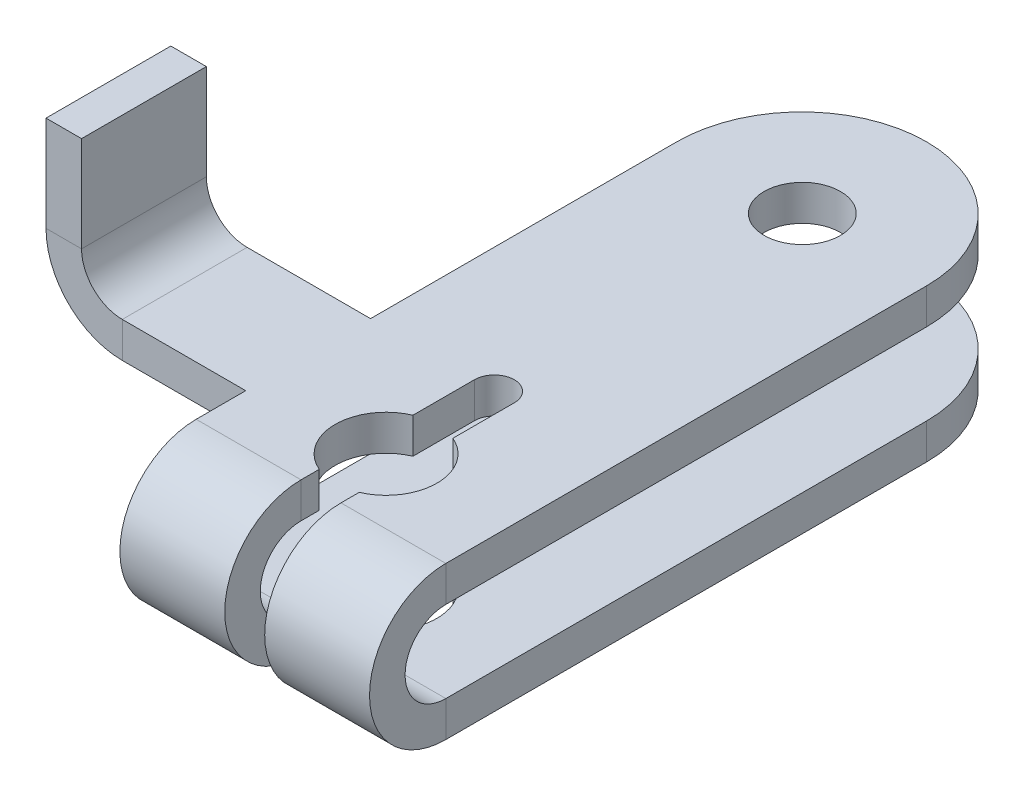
ISO-10303-21;
HEADER;
FILE_DESCRIPTION(('STEP AP214'),'2;1');
FILE_NAME('part.step','',(''),(''),'','','');
FILE_SCHEMA(('AUTOMOTIVE_DESIGN { 1 0 10303 214 1 1 1 1 }'));
ENDSEC;
DATA;
#1=APPLICATION_CONTEXT('core data for automotive mechanical design processes');
#2=APPLICATION_PROTOCOL_DEFINITION('international standard','automotive_design',2000,#1);
#3=PRODUCT_CONTEXT('',#1,'mechanical');
#4=PRODUCT('Part','Part','',(#3));
#5=PRODUCT_RELATED_PRODUCT_CATEGORY('part','',(#4));
#6=PRODUCT_DEFINITION_FORMATION('','',#4);
#7=PRODUCT_DEFINITION_CONTEXT('part definition',#1,'design');
#8=PRODUCT_DEFINITION('design','',#6,#7);
#9=PRODUCT_DEFINITION_SHAPE('','',#8);
#10=(LENGTH_UNIT() NAMED_UNIT(*) SI_UNIT(.MILLI.,.METRE.));
#11=(NAMED_UNIT(*) PLANE_ANGLE_UNIT() SI_UNIT($,.RADIAN.));
#12=(NAMED_UNIT(*) SI_UNIT($,.STERADIAN.) SOLID_ANGLE_UNIT());
#13=UNCERTAINTY_MEASURE_WITH_UNIT(LENGTH_MEASURE(1.E-05),#10,'distance_accuracy_value','');
#14=(GEOMETRIC_REPRESENTATION_CONTEXT(3) GLOBAL_UNCERTAINTY_ASSIGNED_CONTEXT((#13)) GLOBAL_UNIT_ASSIGNED_CONTEXT((#10,
#11,#12)) REPRESENTATION_CONTEXT('',''));
#15=CARTESIAN_POINT('',(0.,0.,0.));
#16=DIRECTION('',(0.,0.,1.));
#17=DIRECTION('',(1.,0.,0.));
#18=AXIS2_PLACEMENT_3D('',#15,#16,#17);
#19=CARTESIAN_POINT('',(7.9375,-2.5908,0.));
#20=DIRECTION('',(0.,1.,0.));
#21=DIRECTION('',(0.,0.,1.));
#22=AXIS2_PLACEMENT_3D('',#19,#20,#21);
#23=PLANE('',#22);
#24=CARTESIAN_POINT('',(0.,-2.5908,-30.607));
#25=DIRECTION('',(0.,1.,0.));
#26=DIRECTION('',(0.,0.,1.));
#27=AXIS2_PLACEMENT_3D('',#24,#25,#26);
#28=CIRCLE('',#27,2.4257);
#29=CARTESIAN_POINT('',(0.,-2.5908,-28.1813));
#30=VERTEX_POINT('',#29);
#31=EDGE_CURVE('E497',#30,#30,#28,.T.);
#32=ORIENTED_EDGE('',*,*,#31,.F.);
#33=EDGE_LOOP('',(#32));
#34=FACE_BOUND('',#33,.T.);
#35=CARTESIAN_POINT('',(0.,-2.5908,-11.0236));
#36=DIRECTION('',(0.,1.,0.));
#37=DIRECTION('',(0.,0.,1.));
#38=AXIS2_PLACEMENT_3D('',#35,#36,#37);
#39=CIRCLE('',#38,1.27);
#40=CARTESIAN_POINT('',(1.27,-2.5908,-11.0236));
#41=VERTEX_POINT('',#40);
#42=CARTESIAN_POINT('',(-1.27,-2.5908,-11.0236));
#43=VERTEX_POINT('',#42);
#44=EDGE_CURVE('E309',#41,#43,#39,.T.);
#45=ORIENTED_EDGE('',*,*,#44,.F.);
#46=DIRECTION('',(0.,0.,-1.));
#47=VECTOR('',#46,1.);
#48=CARTESIAN_POINT('',(1.27,-2.5908,0.));
#49=LINE('',#48,#47);
#50=CARTESIAN_POINT('',(1.27,-2.5908,-7.11632099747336));
#51=VERTEX_POINT('',#50);
#52=EDGE_CURVE('E292',#51,#41,#49,.T.);
#53=ORIENTED_EDGE('',*,*,#52,.F.);
#54=CARTESIAN_POINT('',(0.,-2.5908,-4.13723015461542));
#55=DIRECTION('',(0.,1.,0.));
#56=DIRECTION('',(0.,0.,1.));
#57=AXIS2_PLACEMENT_3D('',#54,#55,#56);
#58=CIRCLE('',#57,3.2385);
#59=CARTESIAN_POINT('',(1.27,-2.5908,-1.15813931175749));
#60=VERTEX_POINT('',#59);
#61=EDGE_CURVE('E395',#60,#51,#58,.T.);
#62=ORIENTED_EDGE('',*,*,#61,.F.);
#63=DIRECTION('',(0.,0.,-1.));
#64=VECTOR('',#63,1.);
#65=CARTESIAN_POINT('',(1.27,-2.5908,0.));
#66=LINE('',#65,#64);
#67=CARTESIAN_POINT('',(1.27,-2.5908,0.));
#68=VERTEX_POINT('',#67);
#69=EDGE_CURVE('E346',#68,#60,#66,.T.);
#70=ORIENTED_EDGE('',*,*,#69,.F.);
#71=DIRECTION('',(-1.,0.,0.));
#72=VECTOR('',#71,1.);
#73=CARTESIAN_POINT('',(7.9375,-2.5908,0.));
#74=LINE('',#73,#72);
#75=CARTESIAN_POINT('',(7.9375,-2.5908,0.));
#76=VERTEX_POINT('',#75);
#77=EDGE_CURVE('E510',#76,#68,#74,.T.);
#78=ORIENTED_EDGE('',*,*,#77,.F.);
#79=DIRECTION('',(0.,0.,-1.));
#80=VECTOR('',#79,1.);
#81=CARTESIAN_POINT('',(7.9375,-2.5908,0.));
#82=LINE('',#81,#80);
#83=CARTESIAN_POINT('',(7.9375,-2.5908,-30.5689));
#84=VERTEX_POINT('',#83);
#85=EDGE_CURVE('E513',#76,#84,#82,.T.);
#86=ORIENTED_EDGE('',*,*,#85,.T.);
#87=CARTESIAN_POINT('',(0.,-2.5908,-30.5689));
#88=DIRECTION('',(0.,1.,0.));
#89=DIRECTION('',(0.,0.,1.));
#90=AXIS2_PLACEMENT_3D('',#87,#88,#89);
#91=CIRCLE('',#90,7.9375);
#92=CARTESIAN_POINT('',(0.,-2.5908,-38.5064));
#93=VERTEX_POINT('',#92);
#94=EDGE_CURVE('E500',#84,#93,#91,.T.);
#95=ORIENTED_EDGE('',*,*,#94,.T.);
#96=CARTESIAN_POINT('',(0.,-2.5908,-30.5689));
#97=DIRECTION('',(0.,1.,0.));
#98=DIRECTION('',(0.,0.,1.));
#99=AXIS2_PLACEMENT_3D('',#96,#97,#98);
#100=CIRCLE('',#99,7.9375);
#101=CARTESIAN_POINT('',(-7.9375,-2.5908,-30.5689));
#102=VERTEX_POINT('',#101);
#103=EDGE_CURVE('E503',#93,#102,#100,.T.);
#104=ORIENTED_EDGE('',*,*,#103,.T.);
#105=DIRECTION('',(0.,0.,-1.));
#106=VECTOR('',#105,1.);
#107=CARTESIAN_POINT('',(-7.9375,-2.5908,0.));
#108=LINE('',#107,#106);
#109=CARTESIAN_POINT('',(-7.9375,-2.5908,0.));
#110=VERTEX_POINT('',#109);
#111=EDGE_CURVE('E506',#110,#102,#108,.T.);
#112=ORIENTED_EDGE('',*,*,#111,.F.);
#113=CARTESIAN_POINT('',(-1.27,-2.5908,0.));
#114=VERTEX_POINT('',#113);
#115=EDGE_CURVE('E509',#114,#110,#74,.T.);
#116=ORIENTED_EDGE('',*,*,#115,.F.);
#117=DIRECTION('',(0.,0.,1.));
#118=VECTOR('',#117,1.);
#119=CARTESIAN_POINT('',(-1.27,-2.5908,0.));
#120=LINE('',#119,#118);
#121=CARTESIAN_POINT('',(-1.27,-2.5908,-1.15813931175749));
#122=VERTEX_POINT('',#121);
#123=EDGE_CURVE('E352',#122,#114,#120,.T.);
#124=ORIENTED_EDGE('',*,*,#123,.F.);
#125=CARTESIAN_POINT('',(-1.27,-2.5908,-7.11632099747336));
#126=VERTEX_POINT('',#125);
#127=EDGE_CURVE('E394',#126,#122,#58,.T.);
#128=ORIENTED_EDGE('',*,*,#127,.F.);
#129=DIRECTION('',(0.,0.,1.));
#130=VECTOR('',#129,1.);
#131=CARTESIAN_POINT('',(-1.27,-2.5908,0.));
#132=LINE('',#131,#130);
#133=EDGE_CURVE('E73',#43,#126,#132,.T.);
#134=ORIENTED_EDGE('',*,*,#133,.F.);
#135=EDGE_LOOP('',(#45,#53,#62,#70,#78,#86,#95,#104,#112,#116,#124,#128,#134));
#136=FACE_BOUND('',#135,.T.);
#137=ADVANCED_FACE('F57',(#34,#136),#23,.T.);
#138=CARTESIAN_POINT('',(7.9375,-4.8514,0.));
#139=DIRECTION('',(0.,1.,0.));
#140=DIRECTION('',(0.,0.,1.));
#141=AXIS2_PLACEMENT_3D('',#138,#139,#140);
#142=PLANE('',#141);
#143=CARTESIAN_POINT('',(0.,-4.8514,-30.607));
#144=DIRECTION('',(0.,1.,0.));
#145=DIRECTION('',(0.,0.,1.));
#146=AXIS2_PLACEMENT_3D('',#143,#144,#145);
#147=CIRCLE('',#146,2.4257);
#148=CARTESIAN_POINT('',(0.,-4.8514,-28.1813));
#149=VERTEX_POINT('',#148);
#150=EDGE_CURVE('E525',#149,#149,#147,.T.);
#151=ORIENTED_EDGE('',*,*,#150,.T.);
#152=EDGE_LOOP('',(#151));
#153=FACE_BOUND('',#152,.T.);
#154=DIRECTION('',(0.,0.,1.));
#155=VECTOR('',#154,1.);
#156=CARTESIAN_POINT('',(1.27,-4.8514,0.));
#157=LINE('',#156,#155);
#158=CARTESIAN_POINT('',(1.27,-4.8514,-7.11632099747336));
#159=VERTEX_POINT('',#158);
#160=CARTESIAN_POINT('',(1.27,-4.8514,-11.0236));
#161=VERTEX_POINT('',#160);
#162=EDGE_CURVE('E296',#159,#161,#157,.F.);
#163=ORIENTED_EDGE('',*,*,#162,.T.);
#164=CARTESIAN_POINT('',(0.,-4.8514,-11.0236));
#165=DIRECTION('',(0.,1.,0.));
#166=DIRECTION('',(0.,0.,1.));
#167=AXIS2_PLACEMENT_3D('',#164,#165,#166);
#168=CIRCLE('',#167,1.27);
#169=CARTESIAN_POINT('',(-1.27,-4.8514,-11.0236));
#170=VERTEX_POINT('',#169);
#171=EDGE_CURVE('E282',#161,#170,#168,.T.);
#172=ORIENTED_EDGE('',*,*,#171,.T.);
#173=DIRECTION('',(0.,0.,1.));
#174=VECTOR('',#173,1.);
#175=CARTESIAN_POINT('',(-1.27,-4.8514,0.));
#176=LINE('',#175,#174);
#177=CARTESIAN_POINT('',(-1.27,-4.8514,-7.11632099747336));
#178=VERTEX_POINT('',#177);
#179=EDGE_CURVE('E291',#170,#178,#176,.T.);
#180=ORIENTED_EDGE('',*,*,#179,.T.);
#181=CARTESIAN_POINT('',(0.,-4.8514,-4.13723015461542));
#182=DIRECTION('',(0.,-1.,0.));
#183=DIRECTION('',(0.,0.,-1.));
#184=AXIS2_PLACEMENT_3D('',#181,#182,#183);
#185=CIRCLE('',#184,3.2385);
#186=CARTESIAN_POINT('',(-1.27,-4.8514,-1.15813931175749));
#187=VERTEX_POINT('',#186);
#188=EDGE_CURVE('E391',#187,#178,#185,.T.);
#189=ORIENTED_EDGE('',*,*,#188,.F.);
#190=DIRECTION('',(0.,0.,1.));
#191=VECTOR('',#190,1.);
#192=CARTESIAN_POINT('',(-1.27,-4.8514,0.));
#193=LINE('',#192,#191);
#194=CARTESIAN_POINT('',(-1.27,-4.8514,0.));
#195=VERTEX_POINT('',#194);
#196=EDGE_CURVE('E81',#187,#195,#193,.T.);
#197=ORIENTED_EDGE('',*,*,#196,.T.);
#198=DIRECTION('',(-1.,0.,0.));
#199=VECTOR('',#198,1.);
#200=CARTESIAN_POINT('',(7.9375,-4.8514,0.));
#201=LINE('',#200,#199);
#202=CARTESIAN_POINT('',(-7.9375,-4.8514,0.));
#203=VERTEX_POINT('',#202);
#204=EDGE_CURVE('E531',#195,#203,#201,.T.);
#205=ORIENTED_EDGE('',*,*,#204,.T.);
#206=DIRECTION('',(0.,0.,1.));
#207=VECTOR('',#206,1.);
#208=CARTESIAN_POINT('',(-7.9375,-4.8514,0.));
#209=LINE('',#208,#207);
#210=CARTESIAN_POINT('',(-7.9375,-4.8514,-30.5689));
#211=VERTEX_POINT('',#210);
#212=EDGE_CURVE('E535',#203,#211,#209,.F.);
#213=ORIENTED_EDGE('',*,*,#212,.T.);
#214=CARTESIAN_POINT('',(0.,-4.8514,-30.5689));
#215=DIRECTION('',(0.,1.,0.));
#216=DIRECTION('',(0.,0.,1.));
#217=AXIS2_PLACEMENT_3D('',#214,#215,#216);
#218=CIRCLE('',#217,7.9375);
#219=CARTESIAN_POINT('',(0.,-4.8514,-38.5064));
#220=VERTEX_POINT('',#219);
#221=EDGE_CURVE('E538',#220,#211,#218,.T.);
#222=ORIENTED_EDGE('',*,*,#221,.F.);
#223=CARTESIAN_POINT('',(0.,-4.8514,-30.5689));
#224=DIRECTION('',(0.,1.,0.));
#225=DIRECTION('',(0.,0.,1.));
#226=AXIS2_PLACEMENT_3D('',#223,#224,#225);
#227=CIRCLE('',#226,7.9375);
#228=CARTESIAN_POINT('',(7.9375,-4.8514,-30.5689));
#229=VERTEX_POINT('',#228);
#230=EDGE_CURVE('E541',#229,#220,#227,.T.);
#231=ORIENTED_EDGE('',*,*,#230,.F.);
#232=DIRECTION('',(0.,0.,1.));
#233=VECTOR('',#232,1.);
#234=CARTESIAN_POINT('',(7.9375,-4.8514,0.));
#235=LINE('',#234,#233);
#236=CARTESIAN_POINT('',(7.9375,-4.8514,0.));
#237=VERTEX_POINT('',#236);
#238=EDGE_CURVE('E530',#237,#229,#235,.F.);
#239=ORIENTED_EDGE('',*,*,#238,.F.);
#240=CARTESIAN_POINT('',(1.27,-4.8514,0.));
#241=VERTEX_POINT('',#240);
#242=EDGE_CURVE('E527',#237,#241,#201,.T.);
#243=ORIENTED_EDGE('',*,*,#242,.T.);
#244=DIRECTION('',(0.,0.,1.));
#245=VECTOR('',#244,1.);
#246=CARTESIAN_POINT('',(1.27,-4.8514,0.));
#247=LINE('',#246,#245);
#248=CARTESIAN_POINT('',(1.27,-4.8514,-1.15813931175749));
#249=VERTEX_POINT('',#248);
#250=EDGE_CURVE('E350',#241,#249,#247,.F.);
#251=ORIENTED_EDGE('',*,*,#250,.T.);
#252=EDGE_CURVE('E304',#159,#249,#185,.T.);
#253=ORIENTED_EDGE('',*,*,#252,.F.);
#254=EDGE_LOOP('',(#163,#172,#180,#189,#197,#205,#213,#222,#231,#239,#243,#251,#253));
#255=FACE_BOUND('',#254,.T.);
#256=ADVANCED_FACE('F302',(#153,#255),#142,.F.);
#257=CARTESIAN_POINT('',(0.,13.5128,-4.13723015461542));
#258=DIRECTION('',(0.,-1.,0.));
#259=DIRECTION('',(0.,0.,-1.));
#260=AXIS2_PLACEMENT_3D('',#257,#258,#259);
#261=CYLINDRICAL_SURFACE('',#260,3.2385);
#262=DIRECTION('',(0.,1.,0.));
#263=VECTOR('',#262,1.);
#264=CARTESIAN_POINT('',(1.27,-2.5908,-7.11632099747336));
#265=LINE('',#264,#263);
#266=EDGE_CURVE('E299',#51,#159,#265,.F.);
#267=ORIENTED_EDGE('',*,*,#266,.T.);
#268=ORIENTED_EDGE('',*,*,#252,.T.);
#269=DIRECTION('',(0.,1.,0.));
#270=VECTOR('',#269,1.);
#271=CARTESIAN_POINT('',(1.27,-2.5908,-1.15813931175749));
#272=LINE('',#271,#270);
#273=EDGE_CURVE('E360',#60,#249,#272,.F.);
#274=ORIENTED_EDGE('',*,*,#273,.F.);
#275=ORIENTED_EDGE('',*,*,#61,.T.);
#276=EDGE_LOOP('',(#267,#268,#274,#275));
#277=FACE_BOUND('',#276,.T.);
#278=ADVANCED_FACE('F626',(#277),#261,.F.);
#279=DIRECTION('',(0.,1.,0.));
#280=VECTOR('',#279,1.);
#281=CARTESIAN_POINT('',(-1.27,-2.5908,-7.11632099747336));
#282=LINE('',#281,#280);
#283=EDGE_CURVE('E314',#126,#178,#282,.F.);
#284=ORIENTED_EDGE('',*,*,#283,.F.);
#285=ORIENTED_EDGE('',*,*,#127,.T.);
#286=DIRECTION('',(0.,1.,0.));
#287=VECTOR('',#286,1.);
#288=CARTESIAN_POINT('',(-1.27,-2.5908,-1.15813931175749));
#289=LINE('',#288,#287);
#290=EDGE_CURVE('E358',#122,#187,#289,.F.);
#291=ORIENTED_EDGE('',*,*,#290,.T.);
#292=ORIENTED_EDGE('',*,*,#188,.T.);
#293=EDGE_LOOP('',(#284,#285,#291,#292));
#294=FACE_BOUND('',#293,.T.);
#295=ADVANCED_FACE('F681',(#294),#261,.F.);
#296=CARTESIAN_POINT('',(7.9375,2.5908,0.));
#297=DIRECTION('',(0.,-1.,0.));
#298=DIRECTION('',(0.,0.,-1.));
#299=AXIS2_PLACEMENT_3D('',#296,#297,#298);
#300=PLANE('',#299);
#301=CARTESIAN_POINT('',(0.,2.5908,-30.607));
#302=DIRECTION('',(0.,-1.,0.));
#303=DIRECTION('',(0.,0.,-1.));
#304=AXIS2_PLACEMENT_3D('',#301,#302,#303);
#305=CIRCLE('',#304,2.4257);
#306=CARTESIAN_POINT('',(0.,2.5908,-33.0327));
#307=VERTEX_POINT('',#306);
#308=EDGE_CURVE('E476',#307,#307,#305,.T.);
#309=ORIENTED_EDGE('',*,*,#308,.F.);
#310=EDGE_LOOP('',(#309));
#311=FACE_BOUND('',#310,.T.);
#312=CARTESIAN_POINT('',(0.,2.5908,-4.13723015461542));
#313=DIRECTION('',(0.,-1.,0.));
#314=DIRECTION('',(0.,0.,-1.));
#315=AXIS2_PLACEMENT_3D('',#312,#313,#314);
#316=CIRCLE('',#315,3.2385);
#317=CARTESIAN_POINT('',(-1.27,2.5908,-1.15813931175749));
#318=VERTEX_POINT('',#317);
#319=CARTESIAN_POINT('',(-1.27,2.5908,-7.11632099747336));
#320=VERTEX_POINT('',#319);
#321=EDGE_CURVE('E402',#318,#320,#316,.T.);
#322=ORIENTED_EDGE('',*,*,#321,.F.);
#323=DIRECTION('',(0.,0.,-1.));
#324=VECTOR('',#323,1.);
#325=CARTESIAN_POINT('',(-1.27,2.5908,0.));
#326=LINE('',#325,#324);
#327=CARTESIAN_POINT('',(-1.27,2.5908,0.));
#328=VERTEX_POINT('',#327);
#329=EDGE_CURVE('E329',#328,#318,#326,.T.);
#330=ORIENTED_EDGE('',*,*,#329,.F.);
#331=DIRECTION('',(-1.,0.,0.));
#332=VECTOR('',#331,1.);
#333=CARTESIAN_POINT('',(7.9375,2.5908,0.));
#334=LINE('',#333,#332);
#335=CARTESIAN_POINT('',(-7.9375,2.5908,0.));
#336=VERTEX_POINT('',#335);
#337=EDGE_CURVE('E493',#328,#336,#334,.T.);
#338=ORIENTED_EDGE('',*,*,#337,.T.);
#339=DIRECTION('',(0.,0.,1.));
#340=VECTOR('',#339,1.);
#341=CARTESIAN_POINT('',(-7.9375,2.5908,0.));
#342=LINE('',#341,#340);
#343=CARTESIAN_POINT('',(-7.9375,2.5908,-3.1496));
#344=VERTEX_POINT('',#343);
#345=EDGE_CURVE('E479',#344,#336,#342,.T.);
#346=ORIENTED_EDGE('',*,*,#345,.F.);
#347=DIRECTION('',(-1.,0.,0.));
#348=VECTOR('',#347,1.);
#349=CARTESIAN_POINT('',(-7.9375,2.5908,-3.1496));
#350=LINE('',#349,#348);
#351=CARTESIAN_POINT('',(-15.7861,2.5908,-3.1496));
#352=VERTEX_POINT('',#351);
#353=EDGE_CURVE('E457',#344,#352,#350,.T.);
#354=ORIENTED_EDGE('',*,*,#353,.T.);
#355=DIRECTION('',(0.,0.,1.));
#356=VECTOR('',#355,1.);
#357=CARTESIAN_POINT('',(-15.7861,2.5908,-3.1496));
#358=LINE('',#357,#356);
#359=CARTESIAN_POINT('',(-15.7861,2.5908,-11.0871));
#360=VERTEX_POINT('',#359);
#361=EDGE_CURVE('E437',#352,#360,#358,.F.);
#362=ORIENTED_EDGE('',*,*,#361,.T.);
#363=DIRECTION('',(1.,0.,0.));
#364=VECTOR('',#363,1.);
#365=CARTESIAN_POINT('',(-7.9375,2.5908,-11.0871));
#366=LINE('',#365,#364);
#367=CARTESIAN_POINT('',(-7.9375,2.5908,-11.0871));
#368=VERTEX_POINT('',#367);
#369=EDGE_CURVE('E464',#360,#368,#366,.T.);
#370=ORIENTED_EDGE('',*,*,#369,.T.);
#371=CARTESIAN_POINT('',(-7.9375,2.5908,-30.5689));
#372=VERTEX_POINT('',#371);
#373=EDGE_CURVE('E481',#372,#368,#342,.T.);
#374=ORIENTED_EDGE('',*,*,#373,.F.);
#375=CARTESIAN_POINT('',(0.,2.5908,-30.5689));
#376=DIRECTION('',(0.,-1.,0.));
#377=DIRECTION('',(0.,0.,-1.));
#378=AXIS2_PLACEMENT_3D('',#375,#376,#377);
#379=CIRCLE('',#378,7.9375);
#380=CARTESIAN_POINT('',(0.,2.5908,-38.5064));
#381=VERTEX_POINT('',#380);
#382=EDGE_CURVE('E484',#372,#381,#379,.T.);
#383=ORIENTED_EDGE('',*,*,#382,.T.);
#384=CARTESIAN_POINT('',(0.,2.5908,-30.5689));
#385=DIRECTION('',(0.,-1.,0.));
#386=DIRECTION('',(0.,0.,-1.));
#387=AXIS2_PLACEMENT_3D('',#384,#385,#386);
#388=CIRCLE('',#387,7.9375);
#389=CARTESIAN_POINT('',(7.9375,2.5908,-30.5689));
#390=VERTEX_POINT('',#389);
#391=EDGE_CURVE('E487',#381,#390,#388,.T.);
#392=ORIENTED_EDGE('',*,*,#391,.T.);
#393=DIRECTION('',(0.,0.,1.));
#394=VECTOR('',#393,1.);
#395=CARTESIAN_POINT('',(7.9375,2.5908,0.));
#396=LINE('',#395,#394);
#397=CARTESIAN_POINT('',(7.9375,2.5908,0.));
#398=VERTEX_POINT('',#397);
#399=EDGE_CURVE('E490',#390,#398,#396,.T.);
#400=ORIENTED_EDGE('',*,*,#399,.T.);
#401=CARTESIAN_POINT('',(1.27,2.5908,0.));
#402=VERTEX_POINT('',#401);
#403=EDGE_CURVE('E494',#398,#402,#334,.T.);
#404=ORIENTED_EDGE('',*,*,#403,.T.);
#405=DIRECTION('',(0.,0.,-1.));
#406=VECTOR('',#405,1.);
#407=CARTESIAN_POINT('',(1.27,2.5908,0.));
#408=LINE('',#407,#406);
#409=CARTESIAN_POINT('',(1.27,2.5908,-1.15813931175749));
#410=VERTEX_POINT('',#409);
#411=EDGE_CURVE('E327',#410,#402,#408,.F.);
#412=ORIENTED_EDGE('',*,*,#411,.F.);
#413=CARTESIAN_POINT('',(1.27,2.5908,-7.11632099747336));
#414=VERTEX_POINT('',#413);
#415=EDGE_CURVE('E403',#414,#410,#316,.T.);
#416=ORIENTED_EDGE('',*,*,#415,.F.);
#417=DIRECTION('',(0.,0.,1.));
#418=VECTOR('',#417,1.);
#419=CARTESIAN_POINT('',(1.27,2.5908,0.));
#420=LINE('',#419,#418);
#421=CARTESIAN_POINT('',(1.27,2.5908,-11.0236));
#422=VERTEX_POINT('',#421);
#423=EDGE_CURVE('E378',#422,#414,#420,.T.);
#424=ORIENTED_EDGE('',*,*,#423,.F.);
#425=CARTESIAN_POINT('',(0.,2.5908,-11.0236));
#426=DIRECTION('',(0.,-1.,0.));
#427=DIRECTION('',(0.,0.,-1.));
#428=AXIS2_PLACEMENT_3D('',#425,#426,#427);
#429=CIRCLE('',#428,1.27);
#430=CARTESIAN_POINT('',(-1.27,2.5908,-11.0236));
#431=VERTEX_POINT('',#430);
#432=EDGE_CURVE('E363',#431,#422,#429,.T.);
#433=ORIENTED_EDGE('',*,*,#432,.F.);
#434=DIRECTION('',(0.,0.,-1.));
#435=VECTOR('',#434,1.);
#436=CARTESIAN_POINT('',(-1.27,2.5908,0.));
#437=LINE('',#436,#435);
#438=EDGE_CURVE('E370',#320,#431,#437,.T.);
#439=ORIENTED_EDGE('',*,*,#438,.F.);
#440=EDGE_LOOP('',(#322,#330,#338,#346,#354,#362,#370,#374,#383,#392,#400,#404,#412,#416,#424,
#433,#439));
#441=FACE_BOUND('',#440,.T.);
#442=ADVANCED_FACE('F590',(#311,#441),#300,.T.);
#443=CARTESIAN_POINT('',(7.9375,4.8514,0.));
#444=DIRECTION('',(0.,-1.,0.));
#445=DIRECTION('',(0.,0.,-1.));
#446=AXIS2_PLACEMENT_3D('',#443,#444,#445);
#447=PLANE('',#446);
#448=CARTESIAN_POINT('',(0.,4.8514,-30.607));
#449=DIRECTION('',(0.,-1.,0.));
#450=DIRECTION('',(0.,0.,-1.));
#451=AXIS2_PLACEMENT_3D('',#448,#449,#450);
#452=CIRCLE('',#451,2.4257);
#453=CARTESIAN_POINT('',(0.,4.8514,-33.0327));
#454=VERTEX_POINT('',#453);
#455=EDGE_CURVE('E473',#454,#454,#452,.T.);
#456=ORIENTED_EDGE('',*,*,#455,.T.);
#457=EDGE_LOOP('',(#456));
#458=FACE_BOUND('',#457,.T.);
#459=DIRECTION('',(0.,0.,-1.));
#460=VECTOR('',#459,1.);
#461=CARTESIAN_POINT('',(-1.27,4.8514,0.));
#462=LINE('',#461,#460);
#463=CARTESIAN_POINT('',(-1.27,4.8514,0.));
#464=VERTEX_POINT('',#463);
#465=CARTESIAN_POINT('',(-1.27,4.8514,-1.15813931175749));
#466=VERTEX_POINT('',#465);
#467=EDGE_CURVE('E330',#464,#466,#462,.T.);
#468=ORIENTED_EDGE('',*,*,#467,.T.);
#469=CARTESIAN_POINT('',(0.,4.8514,-4.13723015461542));
#470=DIRECTION('',(0.,-1.,0.));
#471=DIRECTION('',(0.,0.,-1.));
#472=AXIS2_PLACEMENT_3D('',#469,#470,#471);
#473=CIRCLE('',#472,3.2385);
#474=CARTESIAN_POINT('',(-1.27,4.8514,-7.11632099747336));
#475=VERTEX_POINT('',#474);
#476=EDGE_CURVE('E398',#466,#475,#473,.T.);
#477=ORIENTED_EDGE('',*,*,#476,.T.);
#478=DIRECTION('',(0.,0.,-1.));
#479=VECTOR('',#478,1.);
#480=CARTESIAN_POINT('',(-1.27,4.8514,0.));
#481=LINE('',#480,#479);
#482=CARTESIAN_POINT('',(-1.27,4.8514,-11.0236));
#483=VERTEX_POINT('',#482);
#484=EDGE_CURVE('E371',#475,#483,#481,.T.);
#485=ORIENTED_EDGE('',*,*,#484,.T.);
#486=CARTESIAN_POINT('',(0.,4.8514,-11.0236));
#487=DIRECTION('',(0.,-1.,0.));
#488=DIRECTION('',(0.,0.,-1.));
#489=AXIS2_PLACEMENT_3D('',#486,#487,#488);
#490=CIRCLE('',#489,1.27);
#491=CARTESIAN_POINT('',(1.27,4.8514,-11.0236));
#492=VERTEX_POINT('',#491);
#493=EDGE_CURVE('E366',#483,#492,#490,.T.);
#494=ORIENTED_EDGE('',*,*,#493,.T.);
#495=DIRECTION('',(0.,0.,-1.));
#496=VECTOR('',#495,1.);
#497=CARTESIAN_POINT('',(1.27,4.8514,0.));
#498=LINE('',#497,#496);
#499=CARTESIAN_POINT('',(1.27,4.8514,-7.11632099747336));
#500=VERTEX_POINT('',#499);
#501=EDGE_CURVE('E369',#492,#500,#498,.F.);
#502=ORIENTED_EDGE('',*,*,#501,.T.);
#503=CARTESIAN_POINT('',(1.27,4.8514,-1.15813931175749));
#504=VERTEX_POINT('',#503);
#505=EDGE_CURVE('E399',#500,#504,#473,.T.);
#506=ORIENTED_EDGE('',*,*,#505,.T.);
#507=DIRECTION('',(0.,0.,1.));
#508=VECTOR('',#507,1.);
#509=CARTESIAN_POINT('',(1.27,4.8514,0.));
#510=LINE('',#509,#508);
#511=CARTESIAN_POINT('',(1.27,4.8514,0.));
#512=VERTEX_POINT('',#511);
#513=EDGE_CURVE('E322',#504,#512,#510,.T.);
#514=ORIENTED_EDGE('',*,*,#513,.T.);
#515=DIRECTION('',(1.,0.,0.));
#516=VECTOR('',#515,1.);
#517=CARTESIAN_POINT('',(7.9375,4.8514,0.));
#518=LINE('',#517,#516);
#519=CARTESIAN_POINT('',(7.9375,4.8514,0.));
#520=VERTEX_POINT('',#519);
#521=EDGE_CURVE('E522',#520,#512,#518,.F.);
#522=ORIENTED_EDGE('',*,*,#521,.F.);
#523=DIRECTION('',(0.,0.,-1.));
#524=VECTOR('',#523,1.);
#525=CARTESIAN_POINT('',(7.9375,4.8514,0.));
#526=LINE('',#525,#524);
#527=CARTESIAN_POINT('',(7.9375,4.8514,-30.5689));
#528=VERTEX_POINT('',#527);
#529=EDGE_CURVE('E548',#528,#520,#526,.F.);
#530=ORIENTED_EDGE('',*,*,#529,.F.);
#531=CARTESIAN_POINT('',(0.,4.8514,-30.5689));
#532=DIRECTION('',(0.,-1.,0.));
#533=DIRECTION('',(0.,0.,-1.));
#534=AXIS2_PLACEMENT_3D('',#531,#532,#533);
#535=CIRCLE('',#534,7.9375);
#536=CARTESIAN_POINT('',(0.,4.8514,-38.5064));
#537=VERTEX_POINT('',#536);
#538=EDGE_CURVE('E551',#537,#528,#535,.T.);
#539=ORIENTED_EDGE('',*,*,#538,.F.);
#540=CARTESIAN_POINT('',(0.,4.8514,-30.5689));
#541=DIRECTION('',(0.,-1.,0.));
#542=DIRECTION('',(0.,0.,-1.));
#543=AXIS2_PLACEMENT_3D('',#540,#541,#542);
#544=CIRCLE('',#543,7.9375);
#545=CARTESIAN_POINT('',(-7.9375,4.8514,-30.5689));
#546=VERTEX_POINT('',#545);
#547=EDGE_CURVE('E554',#546,#537,#544,.T.);
#548=ORIENTED_EDGE('',*,*,#547,.F.);
#549=DIRECTION('',(0.,0.,-1.));
#550=VECTOR('',#549,1.);
#551=CARTESIAN_POINT('',(-7.9375,4.8514,0.));
#552=LINE('',#551,#550);
#553=CARTESIAN_POINT('',(-7.9375,4.8514,-11.0871));
#554=VERTEX_POINT('',#553);
#555=EDGE_CURVE('E557',#546,#554,#552,.F.);
#556=ORIENTED_EDGE('',*,*,#555,.T.);
#557=DIRECTION('',(1.,0.,0.));
#558=VECTOR('',#557,1.);
#559=CARTESIAN_POINT('',(-7.9375,4.8514,-11.0871));
#560=LINE('',#559,#558);
#561=CARTESIAN_POINT('',(-15.7861,4.8514,-11.0871));
#562=VERTEX_POINT('',#561);
#563=EDGE_CURVE('E463',#562,#554,#560,.T.);
#564=ORIENTED_EDGE('',*,*,#563,.F.);
#565=DIRECTION('',(0.,0.,1.));
#566=VECTOR('',#565,1.);
#567=CARTESIAN_POINT('',(-15.7861,4.8514,-3.1496));
#568=LINE('',#567,#566);
#569=CARTESIAN_POINT('',(-15.7861,4.8514,-3.1496));
#570=VERTEX_POINT('',#569);
#571=EDGE_CURVE('E450',#570,#562,#568,.F.);
#572=ORIENTED_EDGE('',*,*,#571,.F.);
#573=DIRECTION('',(-1.,0.,0.));
#574=VECTOR('',#573,1.);
#575=CARTESIAN_POINT('',(-7.9375,4.8514,-3.1496));
#576=LINE('',#575,#574);
#577=CARTESIAN_POINT('',(-7.9375,4.8514,-3.1496));
#578=VERTEX_POINT('',#577);
#579=EDGE_CURVE('E460',#578,#570,#576,.T.);
#580=ORIENTED_EDGE('',*,*,#579,.F.);
#581=CARTESIAN_POINT('',(-7.9375,4.8514,0.));
#582=VERTEX_POINT('',#581);
#583=EDGE_CURVE('E560',#578,#582,#552,.F.);
#584=ORIENTED_EDGE('',*,*,#583,.T.);
#585=EDGE_CURVE('E526',#464,#582,#518,.F.);
#586=ORIENTED_EDGE('',*,*,#585,.F.);
#587=EDGE_LOOP('',(#468,#477,#485,#494,#502,#506,#514,#522,#530,#539,#548,#556,#564,#572,#580,
#584,#586));
#588=FACE_BOUND('',#587,.T.);
#589=ADVANCED_FACE('F599',(#458,#588),#447,.F.);
#590=DIRECTION('',(0.,1.,0.));
#591=VECTOR('',#590,1.);
#592=CARTESIAN_POINT('',(-1.27,4.8514,-1.15813931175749));
#593=LINE('',#592,#591);
#594=EDGE_CURVE('E343',#466,#318,#593,.F.);
#595=ORIENTED_EDGE('',*,*,#594,.T.);
#596=ORIENTED_EDGE('',*,*,#321,.T.);
#597=DIRECTION('',(0.,-1.,0.));
#598=VECTOR('',#597,1.);
#599=CARTESIAN_POINT('',(-1.27,2.5908,-7.11632099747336));
#600=LINE('',#599,#598);
#601=EDGE_CURVE('E384',#320,#475,#600,.F.);
#602=ORIENTED_EDGE('',*,*,#601,.T.);
#603=ORIENTED_EDGE('',*,*,#476,.F.);
#604=EDGE_LOOP('',(#595,#596,#602,#603));
#605=FACE_BOUND('',#604,.T.);
#606=ADVANCED_FACE('F667',(#605),#261,.F.);
#607=DIRECTION('',(0.,1.,0.));
#608=VECTOR('',#607,1.);
#609=CARTESIAN_POINT('',(1.27,4.8514,-1.15813931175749));
#610=LINE('',#609,#608);
#611=EDGE_CURVE('E332',#504,#410,#610,.F.);
#612=ORIENTED_EDGE('',*,*,#611,.F.);
#613=ORIENTED_EDGE('',*,*,#505,.F.);
#614=DIRECTION('',(0.,-1.,0.));
#615=VECTOR('',#614,1.);
#616=CARTESIAN_POINT('',(1.27,2.5908,-7.11632099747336));
#617=LINE('',#616,#615);
#618=EDGE_CURVE('E387',#414,#500,#617,.F.);
#619=ORIENTED_EDGE('',*,*,#618,.F.);
#620=ORIENTED_EDGE('',*,*,#415,.T.);
#621=EDGE_LOOP('',(#612,#613,#619,#620));
#622=FACE_BOUND('',#621,.T.);
#623=ADVANCED_FACE('F706',(#622),#261,.F.);
#624=CARTESIAN_POINT('',(7.9375,0.,0.));
#625=DIRECTION('',(-1.,0.,0.));
#626=DIRECTION('',(0.,0.,1.));
#627=AXIS2_PLACEMENT_3D('',#624,#625,#626);
#628=CYLINDRICAL_SURFACE('',#627,2.5908);
#629=ORIENTED_EDGE('',*,*,#337,.F.);
#630=CARTESIAN_POINT('',(-1.27,0.,0.));
#631=DIRECTION('',(-1.,0.,0.));
#632=DIRECTION('',(0.,0.,1.));
#633=AXIS2_PLACEMENT_3D('',#630,#631,#632);
#634=CIRCLE('',#633,2.5908);
#635=EDGE_CURVE('E319',#114,#328,#634,.T.);
#636=ORIENTED_EDGE('',*,*,#635,.F.);
#637=ORIENTED_EDGE('',*,*,#115,.T.);
#638=CARTESIAN_POINT('',(-7.9375,0.,0.));
#639=DIRECTION('',(1.,0.,0.));
#640=DIRECTION('',(0.,0.,-1.));
#641=AXIS2_PLACEMENT_3D('',#638,#639,#640);
#642=CIRCLE('',#641,2.5908);
#643=EDGE_CURVE('E516',#336,#110,#642,.T.);
#644=ORIENTED_EDGE('',*,*,#643,.F.);
#645=EDGE_LOOP('',(#629,#636,#637,#644));
#646=FACE_BOUND('',#645,.T.);
#647=ADVANCED_FACE('F653',(#646),#628,.F.);
#648=ORIENTED_EDGE('',*,*,#77,.T.);
#649=CARTESIAN_POINT('',(1.27,0.,0.));
#650=DIRECTION('',(-1.,0.,0.));
#651=DIRECTION('',(0.,0.,1.));
#652=AXIS2_PLACEMENT_3D('',#649,#650,#651);
#653=CIRCLE('',#652,2.5908);
#654=EDGE_CURVE('E317',#402,#68,#653,.F.);
#655=ORIENTED_EDGE('',*,*,#654,.F.);
#656=ORIENTED_EDGE('',*,*,#403,.F.);
#657=CARTESIAN_POINT('',(7.9375,0.,0.));
#658=DIRECTION('',(1.,0.,0.));
#659=DIRECTION('',(0.,0.,-1.));
#660=AXIS2_PLACEMENT_3D('',#657,#658,#659);
#661=CIRCLE('',#660,2.5908);
#662=EDGE_CURVE('E519',#398,#76,#661,.T.);
#663=ORIENTED_EDGE('',*,*,#662,.T.);
#664=EDGE_LOOP('',(#648,#655,#656,#663));
#665=FACE_BOUND('',#664,.T.);
#666=ADVANCED_FACE('F613',(#665),#628,.F.);
#667=CARTESIAN_POINT('',(7.9375,0.,0.));
#668=DIRECTION('',(-1.,0.,0.));
#669=DIRECTION('',(0.,0.,1.));
#670=AXIS2_PLACEMENT_3D('',#667,#668,#669);
#671=CYLINDRICAL_SURFACE('',#670,4.8514);
#672=CARTESIAN_POINT('',(-1.27,0.,0.));
#673=DIRECTION('',(-1.,0.,0.));
#674=DIRECTION('',(0.,0.,1.));
#675=AXIS2_PLACEMENT_3D('',#672,#673,#674);
#676=CIRCLE('',#675,4.8514);
#677=EDGE_CURVE('E320',#195,#464,#676,.T.);
#678=ORIENTED_EDGE('',*,*,#677,.T.);
#679=ORIENTED_EDGE('',*,*,#585,.T.);
#680=CARTESIAN_POINT('',(-7.9375,0.,0.));
#681=DIRECTION('',(-1.,0.,0.));
#682=DIRECTION('',(0.,0.,1.));
#683=AXIS2_PLACEMENT_3D('',#680,#681,#682);
#684=CIRCLE('',#683,4.8514);
#685=EDGE_CURVE('E532',#582,#203,#684,.F.);
#686=ORIENTED_EDGE('',*,*,#685,.T.);
#687=ORIENTED_EDGE('',*,*,#204,.F.);
#688=EDGE_LOOP('',(#678,#679,#686,#687));
#689=FACE_BOUND('',#688,.T.);
#690=ADVANCED_FACE('F677',(#689),#671,.T.);
#691=CARTESIAN_POINT('',(1.27,0.,0.));
#692=DIRECTION('',(1.,0.,0.));
#693=DIRECTION('',(0.,0.,-1.));
#694=AXIS2_PLACEMENT_3D('',#691,#692,#693);
#695=CIRCLE('',#694,4.8514);
#696=EDGE_CURVE('E315',#512,#241,#695,.T.);
#697=ORIENTED_EDGE('',*,*,#696,.T.);
#698=ORIENTED_EDGE('',*,*,#242,.F.);
#699=CARTESIAN_POINT('',(7.9375,0.,0.));
#700=DIRECTION('',(-1.,0.,0.));
#701=DIRECTION('',(0.,0.,1.));
#702=AXIS2_PLACEMENT_3D('',#699,#700,#701);
#703=CIRCLE('',#702,4.8514);
#704=EDGE_CURVE('E480',#520,#237,#703,.F.);
#705=ORIENTED_EDGE('',*,*,#704,.F.);
#706=ORIENTED_EDGE('',*,*,#521,.T.);
#707=EDGE_LOOP('',(#697,#698,#705,#706));
#708=FACE_BOUND('',#707,.T.);
#709=ADVANCED_FACE('F601',(#708),#671,.T.);
#710=CARTESIAN_POINT('',(-7.9375,4.8514,-3.1496));
#711=DIRECTION('',(0.,0.,1.));
#712=DIRECTION('',(0.,-1.,0.));
#713=AXIS2_PLACEMENT_3D('',#710,#711,#712);
#714=PLANE('',#713);
#715=ORIENTED_EDGE('',*,*,#579,.T.);
#716=DIRECTION('',(0.,-1.,0.));
#717=VECTOR('',#716,1.);
#718=CARTESIAN_POINT('',(-15.7861,4.8514,-3.1496));
#719=LINE('',#718,#717);
#720=EDGE_CURVE('E444',#570,#352,#719,.T.);
#721=ORIENTED_EDGE('',*,*,#720,.T.);
#722=ORIENTED_EDGE('',*,*,#353,.F.);
#723=DIRECTION('',(0.,-1.,0.));
#724=VECTOR('',#723,1.);
#725=CARTESIAN_POINT('',(-7.9375,4.8514,-3.1496));
#726=LINE('',#725,#724);
#727=EDGE_CURVE('E466',#578,#344,#726,.T.);
#728=ORIENTED_EDGE('',*,*,#727,.F.);
#729=EDGE_LOOP('',(#715,#721,#722,#728));
#730=FACE_BOUND('',#729,.T.);
#731=ADVANCED_FACE('F958',(#730),#714,.T.);
#732=CARTESIAN_POINT('',(-7.9375,2.5908,0.));
#733=DIRECTION('',(1.,0.,0.));
#734=DIRECTION('',(0.,0.,1.));
#735=AXIS2_PLACEMENT_3D('',#732,#733,#734);
#736=PLANE('',#735);
#737=DIRECTION('',(0.,-1.,0.));
#738=VECTOR('',#737,1.);
#739=CARTESIAN_POINT('',(-7.9375,4.8514,-11.0871));
#740=LINE('',#739,#738);
#741=EDGE_CURVE('E470',#554,#368,#740,.T.);
#742=ORIENTED_EDGE('',*,*,#741,.F.);
#743=ORIENTED_EDGE('',*,*,#555,.F.);
#744=DIRECTION('',(0.,-1.,0.));
#745=VECTOR('',#744,1.);
#746=CARTESIAN_POINT('',(-7.9375,2.5908,-30.5689));
#747=LINE('',#746,#745);
#748=EDGE_CURVE('E13',#546,#372,#747,.T.);
#749=ORIENTED_EDGE('',*,*,#748,.T.);
#750=ORIENTED_EDGE('',*,*,#373,.T.);
#751=EDGE_LOOP('',(#742,#743,#749,#750));
#752=FACE_BOUND('',#751,.T.);
#753=ADVANCED_FACE('F730',(#752),#736,.F.);
#754=CARTESIAN_POINT('',(0.,2.5908,-30.5689));
#755=DIRECTION('',(0.,-1.,0.));
#756=DIRECTION('',(0.,0.,-1.));
#757=AXIS2_PLACEMENT_3D('',#754,#755,#756);
#758=CYLINDRICAL_SURFACE('',#757,7.9375);
#759=ORIENTED_EDGE('',*,*,#748,.F.);
#760=ORIENTED_EDGE('',*,*,#547,.T.);
#761=DIRECTION('',(0.,-1.,0.));
#762=VECTOR('',#761,1.);
#763=CARTESIAN_POINT('',(0.,2.5908,-38.5064));
#764=LINE('',#763,#762);
#765=EDGE_CURVE('E66',#537,#381,#764,.T.);
#766=ORIENTED_EDGE('',*,*,#765,.T.);
#767=ORIENTED_EDGE('',*,*,#382,.F.);
#768=EDGE_LOOP('',(#759,#760,#766,#767));
#769=FACE_BOUND('',#768,.T.);
#770=ADVANCED_FACE('F582',(#769),#758,.T.);
#771=CARTESIAN_POINT('',(0.,2.5908,-30.5689));
#772=DIRECTION('',(0.,-1.,0.));
#773=DIRECTION('',(0.,0.,-1.));
#774=AXIS2_PLACEMENT_3D('',#771,#772,#773);
#775=CYLINDRICAL_SURFACE('',#774,7.9375);
#776=ORIENTED_EDGE('',*,*,#765,.F.);
#777=ORIENTED_EDGE('',*,*,#538,.T.);
#778=DIRECTION('',(0.,-1.,0.));
#779=VECTOR('',#778,1.);
#780=CARTESIAN_POINT('',(7.9375,2.5908,-30.5689));
#781=LINE('',#780,#779);
#782=EDGE_CURVE('E578',#528,#390,#781,.T.);
#783=ORIENTED_EDGE('',*,*,#782,.T.);
#784=ORIENTED_EDGE('',*,*,#391,.F.);
#785=EDGE_LOOP('',(#776,#777,#783,#784));
#786=FACE_BOUND('',#785,.T.);
#787=ADVANCED_FACE('F592',(#786),#775,.T.);
#788=CARTESIAN_POINT('',(7.9375,2.5908,0.));
#789=DIRECTION('',(1.,0.,0.));
#790=DIRECTION('',(0.,0.,1.));
#791=AXIS2_PLACEMENT_3D('',#788,#789,#790);
#792=PLANE('',#791);
#793=ORIENTED_EDGE('',*,*,#782,.F.);
#794=ORIENTED_EDGE('',*,*,#529,.T.);
#795=DIRECTION('',(0.,-1.,0.));
#796=VECTOR('',#795,1.);
#797=CARTESIAN_POINT('',(7.9375,2.5908,0.));
#798=LINE('',#797,#796);
#799=EDGE_CURVE('E576',#520,#398,#798,.T.);
#800=ORIENTED_EDGE('',*,*,#799,.T.);
#801=ORIENTED_EDGE('',*,*,#399,.F.);
#802=EDGE_LOOP('',(#793,#794,#800,#801));
#803=FACE_BOUND('',#802,.T.);
#804=ADVANCED_FACE('F595',(#803),#792,.T.);
#805=CARTESIAN_POINT('',(7.9375,0.,0.));
#806=DIRECTION('',(-1.,0.,0.));
#807=DIRECTION('',(0.,0.,1.));
#808=AXIS2_PLACEMENT_3D('',#805,#806,#807);
#809=PLANE('',#808);
#810=ORIENTED_EDGE('',*,*,#799,.F.);
#811=ORIENTED_EDGE('',*,*,#704,.T.);
#812=DIRECTION('',(0.,1.,0.));
#813=VECTOR('',#812,1.);
#814=CARTESIAN_POINT('',(7.9375,-2.5908,0.));
#815=LINE('',#814,#813);
#816=EDGE_CURVE('E574',#237,#76,#815,.T.);
#817=ORIENTED_EDGE('',*,*,#816,.T.);
#818=ORIENTED_EDGE('',*,*,#662,.F.);
#819=EDGE_LOOP('',(#810,#811,#817,#818));
#820=FACE_BOUND('',#819,.T.);
#821=ADVANCED_FACE('F605',(#820),#809,.F.);
#822=CARTESIAN_POINT('',(7.9375,-2.5908,0.));
#823=DIRECTION('',(1.,0.,0.));
#824=DIRECTION('',(0.,0.,-1.));
#825=AXIS2_PLACEMENT_3D('',#822,#823,#824);
#826=PLANE('',#825);
#827=ORIENTED_EDGE('',*,*,#816,.F.);
#828=ORIENTED_EDGE('',*,*,#238,.T.);
#829=DIRECTION('',(0.,1.,0.));
#830=VECTOR('',#829,1.);
#831=CARTESIAN_POINT('',(7.9375,-2.5908,-30.5689));
#832=LINE('',#831,#830);
#833=EDGE_CURVE('E572',#229,#84,#832,.T.);
#834=ORIENTED_EDGE('',*,*,#833,.T.);
#835=ORIENTED_EDGE('',*,*,#85,.F.);
#836=EDGE_LOOP('',(#827,#828,#834,#835));
#837=FACE_BOUND('',#836,.T.);
#838=ADVANCED_FACE('F630',(#837),#826,.T.);
#839=CARTESIAN_POINT('',(0.,-2.5908,-30.5689));
#840=DIRECTION('',(0.,1.,0.));
#841=DIRECTION('',(0.,0.,1.));
#842=AXIS2_PLACEMENT_3D('',#839,#840,#841);
#843=CYLINDRICAL_SURFACE('',#842,7.9375);
#844=ORIENTED_EDGE('',*,*,#833,.F.);
#845=ORIENTED_EDGE('',*,*,#230,.T.);
#846=DIRECTION('',(0.,1.,0.));
#847=VECTOR('',#846,1.);
#848=CARTESIAN_POINT('',(0.,-2.5908,-38.5064));
#849=LINE('',#848,#847);
#850=EDGE_CURVE('E570',#220,#93,#849,.T.);
#851=ORIENTED_EDGE('',*,*,#850,.T.);
#852=ORIENTED_EDGE('',*,*,#94,.F.);
#853=EDGE_LOOP('',(#844,#845,#851,#852));
#854=FACE_BOUND('',#853,.T.);
#855=ADVANCED_FACE('F634',(#854),#843,.T.);
#856=CARTESIAN_POINT('',(0.,-2.5908,-30.5689));
#857=DIRECTION('',(0.,1.,0.));
#858=DIRECTION('',(0.,0.,1.));
#859=AXIS2_PLACEMENT_3D('',#856,#857,#858);
#860=CYLINDRICAL_SURFACE('',#859,7.9375);
#861=ORIENTED_EDGE('',*,*,#850,.F.);
#862=ORIENTED_EDGE('',*,*,#221,.T.);
#863=DIRECTION('',(0.,1.,0.));
#864=VECTOR('',#863,1.);
#865=CARTESIAN_POINT('',(-7.9375,-2.5908,-30.5689));
#866=LINE('',#865,#864);
#867=EDGE_CURVE('E568',#211,#102,#866,.T.);
#868=ORIENTED_EDGE('',*,*,#867,.T.);
#869=ORIENTED_EDGE('',*,*,#103,.F.);
#870=EDGE_LOOP('',(#861,#862,#868,#869));
#871=FACE_BOUND('',#870,.T.);
#872=ADVANCED_FACE('F636',(#871),#860,.T.);
#873=CARTESIAN_POINT('',(-7.9375,-2.5908,0.));
#874=DIRECTION('',(1.,0.,0.));
#875=DIRECTION('',(0.,0.,-1.));
#876=AXIS2_PLACEMENT_3D('',#873,#874,#875);
#877=PLANE('',#876);
#878=ORIENTED_EDGE('',*,*,#867,.F.);
#879=ORIENTED_EDGE('',*,*,#212,.F.);
#880=DIRECTION('',(0.,1.,0.));
#881=VECTOR('',#880,1.);
#882=CARTESIAN_POINT('',(-7.9375,-2.5908,0.));
#883=LINE('',#882,#881);
#884=EDGE_CURVE('E565',#203,#110,#883,.T.);
#885=ORIENTED_EDGE('',*,*,#884,.T.);
#886=ORIENTED_EDGE('',*,*,#111,.T.);
#887=EDGE_LOOP('',(#878,#879,#885,#886));
#888=FACE_BOUND('',#887,.T.);
#889=ADVANCED_FACE('F641',(#888),#877,.F.);
#890=CARTESIAN_POINT('',(-7.9375,0.,0.));
#891=DIRECTION('',(-1.,0.,0.));
#892=DIRECTION('',(0.,0.,1.));
#893=AXIS2_PLACEMENT_3D('',#890,#891,#892);
#894=PLANE('',#893);
#895=ORIENTED_EDGE('',*,*,#884,.F.);
#896=ORIENTED_EDGE('',*,*,#685,.F.);
#897=DIRECTION('',(0.,-1.,0.));
#898=VECTOR('',#897,1.);
#899=CARTESIAN_POINT('',(-7.9375,2.5908,0.));
#900=LINE('',#899,#898);
#901=EDGE_CURVE('E61',#582,#336,#900,.T.);
#902=ORIENTED_EDGE('',*,*,#901,.T.);
#903=ORIENTED_EDGE('',*,*,#643,.T.);
#904=EDGE_LOOP('',(#895,#896,#902,#903));
#905=FACE_BOUND('',#904,.T.);
#906=ADVANCED_FACE('F648',(#905),#894,.T.);
#907=CARTESIAN_POINT('',(0.,2.5908,-30.607));
#908=DIRECTION('',(0.,-1.,0.));
#909=DIRECTION('',(0.,0.,-1.));
#910=AXIS2_PLACEMENT_3D('',#907,#908,#909);
#911=CYLINDRICAL_SURFACE('',#910,2.4257);
#912=ORIENTED_EDGE('',*,*,#308,.T.);
#913=EDGE_LOOP('',(#912));
#914=FACE_BOUND('',#913,.T.);
#915=ORIENTED_EDGE('',*,*,#455,.F.);
#916=EDGE_LOOP('',(#915));
#917=FACE_BOUND('',#916,.T.);
#918=ADVANCED_FACE('F59',(#914,#917),#911,.F.);
#919=CARTESIAN_POINT('',(0.,-2.5908,-30.607));
#920=DIRECTION('',(0.,1.,0.));
#921=DIRECTION('',(0.,0.,1.));
#922=AXIS2_PLACEMENT_3D('',#919,#920,#921);
#923=CYLINDRICAL_SURFACE('',#922,2.4257);
#924=ORIENTED_EDGE('',*,*,#31,.T.);
#925=EDGE_LOOP('',(#924));
#926=FACE_BOUND('',#925,.T.);
#927=ORIENTED_EDGE('',*,*,#150,.F.);
#928=EDGE_LOOP('',(#927));
#929=FACE_BOUND('',#928,.T.);
#930=ADVANCED_FACE('F734',(#926,#929),#923,.F.);
#931=ORIENTED_EDGE('',*,*,#727,.T.);
#932=ORIENTED_EDGE('',*,*,#345,.T.);
#933=ORIENTED_EDGE('',*,*,#901,.F.);
#934=ORIENTED_EDGE('',*,*,#583,.F.);
#935=EDGE_LOOP('',(#931,#932,#933,#934));
#936=FACE_BOUND('',#935,.T.);
#937=ADVANCED_FACE('F731',(#936),#736,.F.);
#938=CARTESIAN_POINT('',(-7.9375,4.8514,-11.0871));
#939=DIRECTION('',(0.,0.,-1.));
#940=DIRECTION('',(-1.,0.,0.));
#941=AXIS2_PLACEMENT_3D('',#938,#939,#940);
#942=PLANE('',#941);
#943=DIRECTION('',(0.,-1.,0.));
#944=VECTOR('',#943,1.);
#945=CARTESIAN_POINT('',(-15.7861,4.8514,-11.0871));
#946=LINE('',#945,#944);
#947=EDGE_CURVE('E454',#562,#360,#946,.T.);
#948=ORIENTED_EDGE('',*,*,#947,.F.);
#949=ORIENTED_EDGE('',*,*,#563,.T.);
#950=ORIENTED_EDGE('',*,*,#741,.T.);
#951=ORIENTED_EDGE('',*,*,#369,.F.);
#952=EDGE_LOOP('',(#948,#949,#950,#951));
#953=FACE_BOUND('',#952,.T.);
#954=ADVANCED_FACE('F733',(#953),#942,.T.);
#955=CARTESIAN_POINT('',(-15.7861,7.4422,-11.0871));
#956=DIRECTION('',(0.,0.,-1.));
#957=DIRECTION('',(-1.,0.,0.));
#958=AXIS2_PLACEMENT_3D('',#955,#956,#957);
#959=PLANE('',#958);
#960=DIRECTION('',(1.,0.,0.));
#961=VECTOR('',#960,1.);
#962=CARTESIAN_POINT('',(-20.6375,7.44219999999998,-11.0871));
#963=LINE('',#962,#961);
#964=CARTESIAN_POINT('',(-18.3769,7.44219999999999,-11.0871));
#965=VERTEX_POINT('',#964);
#966=CARTESIAN_POINT('',(-20.6375,7.44219999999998,-11.0871));
#967=VERTEX_POINT('',#966);
#968=EDGE_CURVE('E406',#965,#967,#963,.F.);
#969=ORIENTED_EDGE('',*,*,#968,.F.);
#970=CARTESIAN_POINT('',(-15.7861,7.4422,-11.0871));
#971=DIRECTION('',(0.,0.,1.));
#972=DIRECTION('',(1.,0.,0.));
#973=AXIS2_PLACEMENT_3D('',#970,#971,#972);
#974=CIRCLE('',#973,2.5908);
#975=EDGE_CURVE('E447',#562,#965,#974,.F.);
#976=ORIENTED_EDGE('',*,*,#975,.F.);
#977=ORIENTED_EDGE('',*,*,#947,.T.);
#978=CARTESIAN_POINT('',(-15.7861,7.4422,-11.0871));
#979=DIRECTION('',(0.,0.,1.));
#980=DIRECTION('',(1.,0.,0.));
#981=AXIS2_PLACEMENT_3D('',#978,#979,#980);
#982=CIRCLE('',#981,4.8514);
#983=EDGE_CURVE('E440',#360,#967,#982,.F.);
#984=ORIENTED_EDGE('',*,*,#983,.T.);
#985=EDGE_LOOP('',(#969,#976,#977,#984));
#986=FACE_BOUND('',#985,.T.);
#987=ADVANCED_FACE('F1035',(#986),#959,.T.);
#988=CARTESIAN_POINT('',(-15.7861,7.4422,-3.1496));
#989=DIRECTION('',(0.,0.,-1.));
#990=DIRECTION('',(-1.,0.,0.));
#991=AXIS2_PLACEMENT_3D('',#988,#989,#990);
#992=PLANE('',#991);
#993=CARTESIAN_POINT('',(-15.7861,7.4422,-3.1496));
#994=DIRECTION('',(0.,0.,1.));
#995=DIRECTION('',(1.,0.,0.));
#996=AXIS2_PLACEMENT_3D('',#993,#994,#995);
#997=CIRCLE('',#996,2.5908);
#998=CARTESIAN_POINT('',(-18.3769,7.44219999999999,-3.1496));
#999=VERTEX_POINT('',#998);
#1000=EDGE_CURVE('E410',#999,#570,#997,.T.);
#1001=ORIENTED_EDGE('',*,*,#1000,.F.);
#1002=DIRECTION('',(1.,0.,0.));
#1003=VECTOR('',#1002,1.);
#1004=CARTESIAN_POINT('',(-18.3769,7.44219999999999,-3.1496));
#1005=LINE('',#1004,#1003);
#1006=CARTESIAN_POINT('',(-20.6375,7.44219999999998,-3.1496));
#1007=VERTEX_POINT('',#1006);
#1008=EDGE_CURVE('E430',#999,#1007,#1005,.F.);
#1009=ORIENTED_EDGE('',*,*,#1008,.T.);
#1010=CARTESIAN_POINT('',(-15.7861,7.4422,-3.1496));
#1011=DIRECTION('',(0.,0.,1.));
#1012=DIRECTION('',(1.,0.,0.));
#1013=AXIS2_PLACEMENT_3D('',#1010,#1011,#1012);
#1014=CIRCLE('',#1013,4.8514);
#1015=EDGE_CURVE('E441',#1007,#352,#1014,.T.);
#1016=ORIENTED_EDGE('',*,*,#1015,.T.);
#1017=ORIENTED_EDGE('',*,*,#720,.F.);
#1018=EDGE_LOOP('',(#1001,#1009,#1016,#1017));
#1019=FACE_BOUND('',#1018,.T.);
#1020=ADVANCED_FACE('F1025',(#1019),#992,.F.);
#1021=CARTESIAN_POINT('',(-15.7861,7.4422,-3.1496));
#1022=DIRECTION('',(0.,0.,1.));
#1023=DIRECTION('',(-1.,0.,0.));
#1024=AXIS2_PLACEMENT_3D('',#1021,#1022,#1023);
#1025=CYLINDRICAL_SURFACE('',#1024,4.8514);
#1026=ORIENTED_EDGE('',*,*,#361,.F.);
#1027=ORIENTED_EDGE('',*,*,#1015,.F.);
#1028=DIRECTION('',(0.,0.,1.));
#1029=VECTOR('',#1028,1.);
#1030=CARTESIAN_POINT('',(-20.6375,7.44219999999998,-11.0871));
#1031=LINE('',#1030,#1029);
#1032=EDGE_CURVE('E428',#1007,#967,#1031,.F.);
#1033=ORIENTED_EDGE('',*,*,#1032,.T.);
#1034=ORIENTED_EDGE('',*,*,#983,.F.);
#1035=EDGE_LOOP('',(#1026,#1027,#1033,#1034));
#1036=FACE_BOUND('',#1035,.T.);
#1037=ADVANCED_FACE('F1015',(#1036),#1025,.T.);
#1038=CARTESIAN_POINT('',(-15.7861,7.4422,-3.1496));
#1039=DIRECTION('',(0.,0.,1.));
#1040=DIRECTION('',(-1.,0.,0.));
#1041=AXIS2_PLACEMENT_3D('',#1038,#1039,#1040);
#1042=CYLINDRICAL_SURFACE('',#1041,2.5908);
#1043=ORIENTED_EDGE('',*,*,#571,.T.);
#1044=ORIENTED_EDGE('',*,*,#975,.T.);
#1045=DIRECTION('',(0.,0.,1.));
#1046=VECTOR('',#1045,1.);
#1047=CARTESIAN_POINT('',(-18.3769,7.44219999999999,-11.0871));
#1048=LINE('',#1047,#1046);
#1049=EDGE_CURVE('E433',#965,#999,#1048,.T.);
#1050=ORIENTED_EDGE('',*,*,#1049,.T.);
#1051=ORIENTED_EDGE('',*,*,#1000,.T.);
#1052=EDGE_LOOP('',(#1043,#1044,#1050,#1051));
#1053=FACE_BOUND('',#1052,.T.);
#1054=ADVANCED_FACE('F1005',(#1053),#1042,.F.);
#1055=CARTESIAN_POINT('',(-20.6375,13.5128,-3.1496));
#1056=DIRECTION('',(0.,0.,-1.));
#1057=DIRECTION('',(-1.,0.,0.));
#1058=AXIS2_PLACEMENT_3D('',#1055,#1056,#1057);
#1059=PLANE('',#1058);
#1060=ORIENTED_EDGE('',*,*,#1008,.F.);
#1061=DIRECTION('',(0.,-1.,0.));
#1062=VECTOR('',#1061,1.);
#1063=CARTESIAN_POINT('',(-18.3769,13.5128,-3.1496));
#1064=LINE('',#1063,#1062);
#1065=CARTESIAN_POINT('',(-18.3769,13.5128,-3.1496));
#1066=VERTEX_POINT('',#1065);
#1067=EDGE_CURVE('E426',#999,#1066,#1064,.F.);
#1068=ORIENTED_EDGE('',*,*,#1067,.T.);
#1069=DIRECTION('',(1.,0.,0.));
#1070=VECTOR('',#1069,1.);
#1071=CARTESIAN_POINT('',(-20.6375,13.5128,-3.1496));
#1072=LINE('',#1071,#1070);
#1073=CARTESIAN_POINT('',(-20.6375,13.5128,-3.1496));
#1074=VERTEX_POINT('',#1073);
#1075=EDGE_CURVE('E407',#1074,#1066,#1072,.T.);
#1076=ORIENTED_EDGE('',*,*,#1075,.F.);
#1077=DIRECTION('',(0.,1.,0.));
#1078=VECTOR('',#1077,1.);
#1079=CARTESIAN_POINT('',(-20.6375,0.,-3.1496));
#1080=LINE('',#1079,#1078);
#1081=EDGE_CURVE('E419',#1007,#1074,#1080,.T.);
#1082=ORIENTED_EDGE('',*,*,#1081,.F.);
#1083=EDGE_LOOP('',(#1060,#1068,#1076,#1082));
#1084=FACE_BOUND('',#1083,.T.);
#1085=ADVANCED_FACE('F995',(#1084),#1059,.F.);
#1086=CARTESIAN_POINT('',(-20.6375,4.85139999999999,-11.0871));
#1087=DIRECTION('',(0.,0.,1.));
#1088=DIRECTION('',(1.,0.,0.));
#1089=AXIS2_PLACEMENT_3D('',#1086,#1087,#1088);
#1090=PLANE('',#1089);
#1091=ORIENTED_EDGE('',*,*,#968,.T.);
#1092=DIRECTION('',(0.,-1.,0.));
#1093=VECTOR('',#1092,1.);
#1094=CARTESIAN_POINT('',(-20.6375,0.,-11.0871));
#1095=LINE('',#1094,#1093);
#1096=CARTESIAN_POINT('',(-20.6375,13.5128,-11.0871));
#1097=VERTEX_POINT('',#1096);
#1098=EDGE_CURVE('E414',#1097,#967,#1095,.T.);
#1099=ORIENTED_EDGE('',*,*,#1098,.F.);
#1100=DIRECTION('',(1.,0.,0.));
#1101=VECTOR('',#1100,1.);
#1102=CARTESIAN_POINT('',(-20.6375,13.5128,-11.0871));
#1103=LINE('',#1102,#1101);
#1104=CARTESIAN_POINT('',(-18.3769,13.5128,-11.0871));
#1105=VERTEX_POINT('',#1104);
#1106=EDGE_CURVE('E411',#1097,#1105,#1103,.T.);
#1107=ORIENTED_EDGE('',*,*,#1106,.T.);
#1108=DIRECTION('',(0.,1.,0.));
#1109=VECTOR('',#1108,1.);
#1110=CARTESIAN_POINT('',(-18.3769,4.8514,-11.0871));
#1111=LINE('',#1110,#1109);
#1112=EDGE_CURVE('E421',#1105,#965,#1111,.F.);
#1113=ORIENTED_EDGE('',*,*,#1112,.T.);
#1114=EDGE_LOOP('',(#1091,#1099,#1107,#1113));
#1115=FACE_BOUND('',#1114,.T.);
#1116=ADVANCED_FACE('F986',(#1115),#1090,.F.);
#1117=CARTESIAN_POINT('',(-20.6375,0.,0.));
#1118=DIRECTION('',(1.,0.,0.));
#1119=DIRECTION('',(0.,1.,0.));
#1120=AXIS2_PLACEMENT_3D('',#1117,#1118,#1119);
#1121=PLANE('',#1120);
#1122=ORIENTED_EDGE('',*,*,#1032,.F.);
#1123=ORIENTED_EDGE('',*,*,#1081,.T.);
#1124=DIRECTION('',(0.,0.,-1.));
#1125=VECTOR('',#1124,1.);
#1126=CARTESIAN_POINT('',(-20.6375,13.5128,0.));
#1127=LINE('',#1126,#1125);
#1128=EDGE_CURVE('E417',#1074,#1097,#1127,.T.);
#1129=ORIENTED_EDGE('',*,*,#1128,.T.);
#1130=ORIENTED_EDGE('',*,*,#1098,.T.);
#1131=EDGE_LOOP('',(#1122,#1123,#1129,#1130));
#1132=FACE_BOUND('',#1131,.T.);
#1133=ADVANCED_FACE('F976',(#1132),#1121,.F.);
#1134=CARTESIAN_POINT('',(-18.3769,0.,0.));
#1135=DIRECTION('',(1.,0.,0.));
#1136=DIRECTION('',(0.,1.,0.));
#1137=AXIS2_PLACEMENT_3D('',#1134,#1135,#1136);
#1138=PLANE('',#1137);
#1139=ORIENTED_EDGE('',*,*,#1067,.F.);
#1140=ORIENTED_EDGE('',*,*,#1049,.F.);
#1141=ORIENTED_EDGE('',*,*,#1112,.F.);
#1142=DIRECTION('',(0.,0.,1.));
#1143=VECTOR('',#1142,1.);
#1144=CARTESIAN_POINT('',(-18.3769,13.5128,-11.0871));
#1145=LINE('',#1144,#1143);
#1146=EDGE_CURVE('E424',#1066,#1105,#1145,.F.);
#1147=ORIENTED_EDGE('',*,*,#1146,.F.);
#1148=EDGE_LOOP('',(#1139,#1140,#1141,#1147));
#1149=FACE_BOUND('',#1148,.T.);
#1150=ADVANCED_FACE('F966',(#1149),#1138,.T.);
#1151=CARTESIAN_POINT('',(-20.6375,13.5128,-11.0871));
#1152=DIRECTION('',(0.,-1.,0.));
#1153=DIRECTION('',(1.,0.,0.));
#1154=AXIS2_PLACEMENT_3D('',#1151,#1152,#1153);
#1155=PLANE('',#1154);
#1156=ORIENTED_EDGE('',*,*,#1146,.T.);
#1157=ORIENTED_EDGE('',*,*,#1106,.F.);
#1158=ORIENTED_EDGE('',*,*,#1128,.F.);
#1159=ORIENTED_EDGE('',*,*,#1075,.T.);
#1160=EDGE_LOOP('',(#1156,#1157,#1158,#1159));
#1161=FACE_BOUND('',#1160,.T.);
#1162=ADVANCED_FACE('F781',(#1161),#1155,.F.);
#1163=CARTESIAN_POINT('',(-1.27,2.5908,0.));
#1164=DIRECTION('',(-1.,0.,0.));
#1165=DIRECTION('',(0.,0.,-1.));
#1166=AXIS2_PLACEMENT_3D('',#1163,#1164,#1165);
#1167=PLANE('',#1166);
#1168=ORIENTED_EDGE('',*,*,#601,.F.);
#1169=ORIENTED_EDGE('',*,*,#438,.T.);
#1170=DIRECTION('',(0.,-1.,0.));
#1171=VECTOR('',#1170,1.);
#1172=CARTESIAN_POINT('',(-1.27,2.5908,-11.0236));
#1173=LINE('',#1172,#1171);
#1174=EDGE_CURVE('E381',#431,#483,#1173,.F.);
#1175=ORIENTED_EDGE('',*,*,#1174,.T.);
#1176=ORIENTED_EDGE('',*,*,#484,.F.);
#1177=EDGE_LOOP('',(#1168,#1169,#1175,#1176));
#1178=FACE_BOUND('',#1177,.T.);
#1179=ADVANCED_FACE('F671',(#1178),#1167,.F.);
#1180=CARTESIAN_POINT('',(0.,2.5908,-11.0236));
#1181=DIRECTION('',(0.,-1.,0.));
#1182=DIRECTION('',(0.,0.,-1.));
#1183=AXIS2_PLACEMENT_3D('',#1180,#1181,#1182);
#1184=CYLINDRICAL_SURFACE('',#1183,1.27);
#1185=ORIENTED_EDGE('',*,*,#1174,.F.);
#1186=ORIENTED_EDGE('',*,*,#432,.T.);
#1187=DIRECTION('',(0.,-1.,0.));
#1188=VECTOR('',#1187,1.);
#1189=CARTESIAN_POINT('',(1.27,2.5908,-11.0236));
#1190=LINE('',#1189,#1188);
#1191=EDGE_CURVE('E374',#422,#492,#1190,.F.);
#1192=ORIENTED_EDGE('',*,*,#1191,.T.);
#1193=ORIENTED_EDGE('',*,*,#493,.F.);
#1194=EDGE_LOOP('',(#1185,#1186,#1192,#1193));
#1195=FACE_BOUND('',#1194,.T.);
#1196=ADVANCED_FACE('F774',(#1195),#1184,.F.);
#1197=CARTESIAN_POINT('',(1.27,2.5908,0.));
#1198=DIRECTION('',(1.,0.,0.));
#1199=DIRECTION('',(0.,0.,1.));
#1200=AXIS2_PLACEMENT_3D('',#1197,#1198,#1199);
#1201=PLANE('',#1200);
#1202=ORIENTED_EDGE('',*,*,#423,.T.);
#1203=ORIENTED_EDGE('',*,*,#618,.T.);
#1204=ORIENTED_EDGE('',*,*,#501,.F.);
#1205=ORIENTED_EDGE('',*,*,#1191,.F.);
#1206=EDGE_LOOP('',(#1202,#1203,#1204,#1205));
#1207=FACE_BOUND('',#1206,.T.);
#1208=ADVANCED_FACE('F771',(#1207),#1201,.F.);
#1209=CARTESIAN_POINT('',(1.27,-2.5908,0.));
#1210=DIRECTION('',(1.,0.,0.));
#1211=DIRECTION('',(0.,0.,-1.));
#1212=AXIS2_PLACEMENT_3D('',#1209,#1210,#1211);
#1213=PLANE('',#1212);
#1214=ORIENTED_EDGE('',*,*,#69,.T.);
#1215=ORIENTED_EDGE('',*,*,#273,.T.);
#1216=ORIENTED_EDGE('',*,*,#250,.F.);
#1217=DIRECTION('',(0.,1.,0.));
#1218=VECTOR('',#1217,1.);
#1219=CARTESIAN_POINT('',(1.27,-2.5908,0.));
#1220=LINE('',#1219,#1218);
#1221=EDGE_CURVE('E349',#68,#241,#1220,.F.);
#1222=ORIENTED_EDGE('',*,*,#1221,.F.);
#1223=EDGE_LOOP('',(#1214,#1215,#1216,#1222));
#1224=FACE_BOUND('',#1223,.T.);
#1225=ADVANCED_FACE('F621',(#1224),#1213,.F.);
#1226=CARTESIAN_POINT('',(1.27,0.,0.));
#1227=DIRECTION('',(-1.,0.,0.));
#1228=DIRECTION('',(0.,0.,1.));
#1229=AXIS2_PLACEMENT_3D('',#1226,#1227,#1228);
#1230=PLANE('',#1229);
#1231=ORIENTED_EDGE('',*,*,#1221,.T.);
#1232=ORIENTED_EDGE('',*,*,#696,.F.);
#1233=DIRECTION('',(0.,1.,0.));
#1234=VECTOR('',#1233,1.);
#1235=CARTESIAN_POINT('',(1.27,4.8514,0.));
#1236=LINE('',#1235,#1234);
#1237=EDGE_CURVE('E337',#512,#402,#1236,.F.);
#1238=ORIENTED_EDGE('',*,*,#1237,.T.);
#1239=ORIENTED_EDGE('',*,*,#654,.T.);
#1240=EDGE_LOOP('',(#1231,#1232,#1238,#1239));
#1241=FACE_BOUND('',#1240,.T.);
#1242=ADVANCED_FACE('F617',(#1241),#1230,.T.);
#1243=CARTESIAN_POINT('',(1.27,4.8514,0.));
#1244=DIRECTION('',(1.,0.,0.));
#1245=DIRECTION('',(0.,0.,1.));
#1246=AXIS2_PLACEMENT_3D('',#1243,#1244,#1245);
#1247=PLANE('',#1246);
#1248=ORIENTED_EDGE('',*,*,#1237,.F.);
#1249=ORIENTED_EDGE('',*,*,#513,.F.);
#1250=ORIENTED_EDGE('',*,*,#611,.T.);
#1251=ORIENTED_EDGE('',*,*,#411,.T.);
#1252=EDGE_LOOP('',(#1248,#1249,#1250,#1251));
#1253=FACE_BOUND('',#1252,.T.);
#1254=ADVANCED_FACE('F788',(#1253),#1247,.F.);
#1255=CARTESIAN_POINT('',(-1.27,-2.5908,0.));
#1256=DIRECTION('',(-1.,0.,0.));
#1257=DIRECTION('',(0.,0.,1.));
#1258=AXIS2_PLACEMENT_3D('',#1255,#1256,#1257);
#1259=PLANE('',#1258);
#1260=ORIENTED_EDGE('',*,*,#290,.F.);
#1261=ORIENTED_EDGE('',*,*,#123,.T.);
#1262=DIRECTION('',(0.,1.,0.));
#1263=VECTOR('',#1262,1.);
#1264=CARTESIAN_POINT('',(-1.27,-2.5908,0.));
#1265=LINE('',#1264,#1263);
#1266=EDGE_CURVE('E356',#114,#195,#1265,.F.);
#1267=ORIENTED_EDGE('',*,*,#1266,.T.);
#1268=ORIENTED_EDGE('',*,*,#196,.F.);
#1269=EDGE_LOOP('',(#1260,#1261,#1267,#1268));
#1270=FACE_BOUND('',#1269,.T.);
#1271=ADVANCED_FACE('F678',(#1270),#1259,.F.);
#1272=CARTESIAN_POINT('',(-1.27,4.8514,0.));
#1273=DIRECTION('',(-1.,0.,0.));
#1274=DIRECTION('',(0.,0.,-1.));
#1275=AXIS2_PLACEMENT_3D('',#1272,#1273,#1274);
#1276=PLANE('',#1275);
#1277=ORIENTED_EDGE('',*,*,#594,.F.);
#1278=ORIENTED_EDGE('',*,*,#467,.F.);
#1279=DIRECTION('',(0.,1.,0.));
#1280=VECTOR('',#1279,1.);
#1281=CARTESIAN_POINT('',(-1.27,4.8514,0.));
#1282=LINE('',#1281,#1280);
#1283=EDGE_CURVE('E340',#464,#328,#1282,.F.);
#1284=ORIENTED_EDGE('',*,*,#1283,.T.);
#1285=ORIENTED_EDGE('',*,*,#329,.T.);
#1286=EDGE_LOOP('',(#1277,#1278,#1284,#1285));
#1287=FACE_BOUND('',#1286,.T.);
#1288=ADVANCED_FACE('F660',(#1287),#1276,.F.);
#1289=CARTESIAN_POINT('',(-1.27,0.,0.));
#1290=DIRECTION('',(1.,0.,0.));
#1291=DIRECTION('',(0.,0.,-1.));
#1292=AXIS2_PLACEMENT_3D('',#1289,#1290,#1291);
#1293=PLANE('',#1292);
#1294=ORIENTED_EDGE('',*,*,#1283,.F.);
#1295=ORIENTED_EDGE('',*,*,#677,.F.);
#1296=ORIENTED_EDGE('',*,*,#1266,.F.);
#1297=ORIENTED_EDGE('',*,*,#635,.T.);
#1298=EDGE_LOOP('',(#1294,#1295,#1296,#1297));
#1299=FACE_BOUND('',#1298,.T.);
#1300=ADVANCED_FACE('F656',(#1299),#1293,.T.);
#1301=CARTESIAN_POINT('',(1.27,-2.5908,0.));
#1302=DIRECTION('',(1.,0.,0.));
#1303=DIRECTION('',(0.,0.,-1.));
#1304=AXIS2_PLACEMENT_3D('',#1301,#1302,#1303);
#1305=PLANE('',#1304);
#1306=ORIENTED_EDGE('',*,*,#266,.F.);
#1307=ORIENTED_EDGE('',*,*,#52,.T.);
#1308=DIRECTION('',(0.,1.,0.));
#1309=VECTOR('',#1308,1.);
#1310=CARTESIAN_POINT('',(1.27,-2.5908,-11.0236));
#1311=LINE('',#1310,#1309);
#1312=EDGE_CURVE('E285',#41,#161,#1311,.F.);
#1313=ORIENTED_EDGE('',*,*,#1312,.T.);
#1314=ORIENTED_EDGE('',*,*,#162,.F.);
#1315=EDGE_LOOP('',(#1306,#1307,#1313,#1314));
#1316=FACE_BOUND('',#1315,.T.);
#1317=ADVANCED_FACE('F295',(#1316),#1305,.F.);
#1318=CARTESIAN_POINT('',(0.,-2.5908,-11.0236));
#1319=DIRECTION('',(0.,1.,0.));
#1320=DIRECTION('',(0.,0.,1.));
#1321=AXIS2_PLACEMENT_3D('',#1318,#1319,#1320);
#1322=CYLINDRICAL_SURFACE('',#1321,1.27);
#1323=ORIENTED_EDGE('',*,*,#1312,.F.);
#1324=ORIENTED_EDGE('',*,*,#44,.T.);
#1325=DIRECTION('',(0.,1.,0.));
#1326=VECTOR('',#1325,1.);
#1327=CARTESIAN_POINT('',(-1.27,-2.5908,-11.0236));
#1328=LINE('',#1327,#1326);
#1329=EDGE_CURVE('E287',#43,#170,#1328,.F.);
#1330=ORIENTED_EDGE('',*,*,#1329,.T.);
#1331=ORIENTED_EDGE('',*,*,#171,.F.);
#1332=EDGE_LOOP('',(#1323,#1324,#1330,#1331));
#1333=FACE_BOUND('',#1332,.T.);
#1334=ADVANCED_FACE('F284',(#1333),#1322,.F.);
#1335=CARTESIAN_POINT('',(-1.27,-2.5908,0.));
#1336=DIRECTION('',(-1.,0.,0.));
#1337=DIRECTION('',(0.,0.,1.));
#1338=AXIS2_PLACEMENT_3D('',#1335,#1336,#1337);
#1339=PLANE('',#1338);
#1340=ORIENTED_EDGE('',*,*,#133,.T.);
#1341=ORIENTED_EDGE('',*,*,#283,.T.);
#1342=ORIENTED_EDGE('',*,*,#179,.F.);
#1343=ORIENTED_EDGE('',*,*,#1329,.F.);
#1344=EDGE_LOOP('',(#1340,#1341,#1342,#1343));
#1345=FACE_BOUND('',#1344,.T.);
#1346=ADVANCED_FACE('F683',(#1345),#1339,.F.);
#1347=CLOSED_SHELL('',(#137,#256,#278,#295,#442,#589,#606,#623,#647,#666,#690,#709,#731,#753,
#770,#787,#804,#821,#838,#855,#872,#889,#906,#918,#930,#937,#954,#987,#1020,#1037,#1054,#1085,
#1116,#1133,#1150,#1162,#1179,#1196,#1208,#1225,#1242,#1254,#1271,#1288,#1300,#1317,#1334,#1346));
#1348=MANIFOLD_SOLID_BREP('B2',#1347);
#1349=ADVANCED_BREP_SHAPE_REPRESENTATION('',(#18,#1348),#14);
#1350=SHAPE_DEFINITION_REPRESENTATION(#9,#1349);
ENDSEC;
END-ISO-10303-21;
